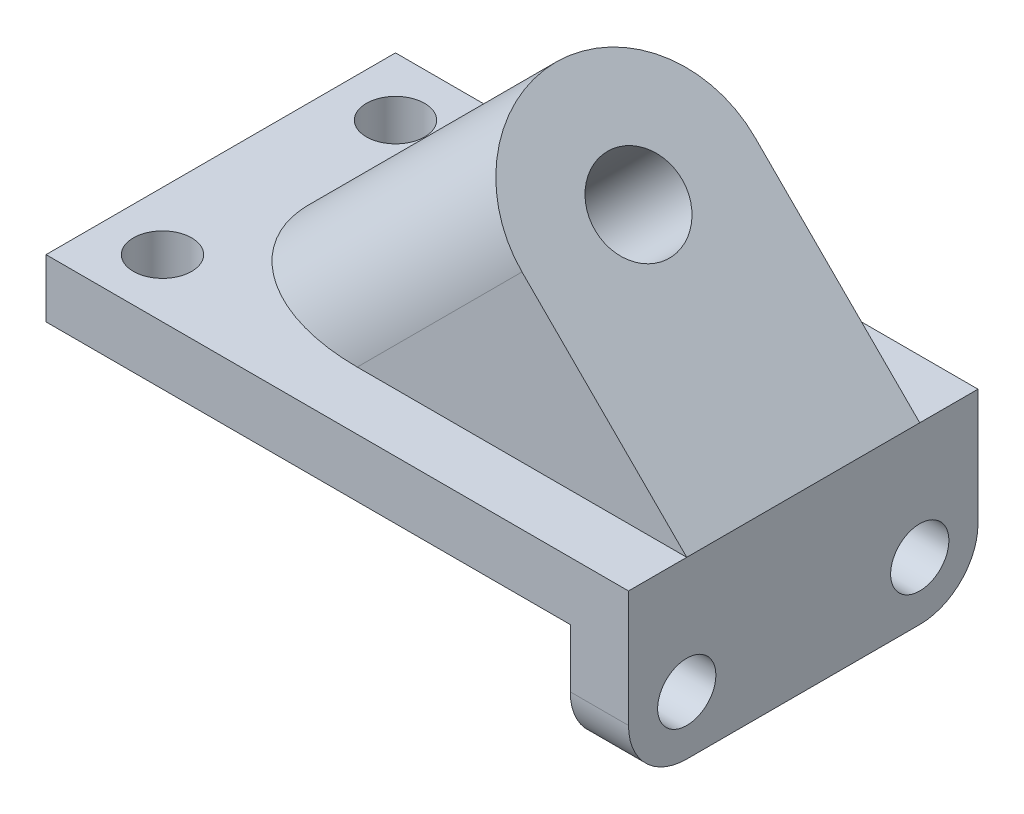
ISO-10303-21;
HEADER;
FILE_DESCRIPTION(('STEP AP214'),'2;1');
FILE_NAME('part.step','',(''),(''),'','','');
FILE_SCHEMA(('AUTOMOTIVE_DESIGN { 1 0 10303 214 1 1 1 1 }'));
ENDSEC;
DATA;
#1=APPLICATION_CONTEXT('core data for automotive mechanical design processes');
#2=APPLICATION_PROTOCOL_DEFINITION('international standard','automotive_design',2000,#1);
#3=PRODUCT_CONTEXT('',#1,'mechanical');
#4=PRODUCT('Part','Part','',(#3));
#5=PRODUCT_RELATED_PRODUCT_CATEGORY('part','',(#4));
#6=PRODUCT_DEFINITION_FORMATION('','',#4);
#7=PRODUCT_DEFINITION_CONTEXT('part definition',#1,'design');
#8=PRODUCT_DEFINITION('design','',#6,#7);
#9=PRODUCT_DEFINITION_SHAPE('','',#8);
#10=(LENGTH_UNIT() NAMED_UNIT(*) SI_UNIT(.MILLI.,.METRE.));
#11=(NAMED_UNIT(*) PLANE_ANGLE_UNIT() SI_UNIT($,.RADIAN.));
#12=(NAMED_UNIT(*) SI_UNIT($,.STERADIAN.) SOLID_ANGLE_UNIT());
#13=UNCERTAINTY_MEASURE_WITH_UNIT(LENGTH_MEASURE(1.E-05),#10,'distance_accuracy_value','');
#14=(GEOMETRIC_REPRESENTATION_CONTEXT(3) GLOBAL_UNCERTAINTY_ASSIGNED_CONTEXT((#13)) GLOBAL_UNIT_ASSIGNED_CONTEXT((#10,
#11,#12)) REPRESENTATION_CONTEXT('',''));
#15=CARTESIAN_POINT('',(0.,0.,0.));
#16=DIRECTION('',(0.,0.,1.));
#17=DIRECTION('',(1.,0.,0.));
#18=AXIS2_PLACEMENT_3D('',#15,#16,#17);
#19=CARTESIAN_POINT('',(0.,-12.7,0.));
#20=DIRECTION('',(0.,-1.,0.));
#21=DIRECTION('',(0.,0.,-1.));
#22=AXIS2_PLACEMENT_3D('',#19,#20,#21);
#23=PLANE('',#22);
#24=CARTESIAN_POINT('',(42.4579510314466,-12.7,-38.1));
#25=DIRECTION('',(0.,-1.,0.));
#26=DIRECTION('',(1.,0.,0.));
#27=AXIS2_PLACEMENT_3D('',#24,#25,#26);
#28=ELLIPSE('',#27,13.4703841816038,9.52500000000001);
#29=CARTESIAN_POINT('',(55.9283352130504,-12.7,-38.1));
#30=VERTEX_POINT('',#29);
#31=EDGE_CURVE('E161',#30,#30,#28,.T.);
#32=ORIENTED_EDGE('',*,*,#31,.F.);
#33=EDGE_LOOP('',(#32));
#34=FACE_BOUND('',#33,.T.);
#35=CARTESIAN_POINT('',(12.7,-12.7,-63.5));
#36=DIRECTION('',(0.,1.,0.));
#37=DIRECTION('',(0.,0.,1.));
#38=AXIS2_PLACEMENT_3D('',#35,#36,#37);
#39=CIRCLE('',#38,6.35);
#40=CARTESIAN_POINT('',(12.7,-12.7,-57.15));
#41=VERTEX_POINT('',#40);
#42=EDGE_CURVE('E238',#41,#41,#39,.T.);
#43=ORIENTED_EDGE('',*,*,#42,.T.);
#44=EDGE_LOOP('',(#43));
#45=FACE_BOUND('',#44,.T.);
#46=CARTESIAN_POINT('',(12.7,-12.7,-12.7));
#47=DIRECTION('',(0.,1.,0.));
#48=DIRECTION('',(0.,0.,1.));
#49=AXIS2_PLACEMENT_3D('',#46,#47,#48);
#50=CIRCLE('',#49,6.35);
#51=CARTESIAN_POINT('',(12.7,-12.7,-6.35));
#52=VERTEX_POINT('',#51);
#53=EDGE_CURVE('E246',#52,#52,#50,.T.);
#54=ORIENTED_EDGE('',*,*,#53,.T.);
#55=EDGE_LOOP('',(#54));
#56=FACE_BOUND('',#55,.T.);
#57=DIRECTION('',(-1.,0.,0.));
#58=VECTOR('',#57,1.);
#59=CARTESIAN_POINT('',(0.,-12.7,-76.2));
#60=LINE('',#59,#58);
#61=CARTESIAN_POINT('',(114.3,-12.7,-76.2));
#62=VERTEX_POINT('',#61);
#63=CARTESIAN_POINT('',(0.,-12.7,-76.2));
#64=VERTEX_POINT('',#63);
#65=EDGE_CURVE('E263',#62,#64,#60,.T.);
#66=ORIENTED_EDGE('',*,*,#65,.F.);
#67=DIRECTION('',(0.,0.,1.));
#68=VECTOR('',#67,1.);
#69=CARTESIAN_POINT('',(114.3,-12.7,0.));
#70=LINE('',#69,#68);
#71=CARTESIAN_POINT('',(114.3,-12.7,0.));
#72=VERTEX_POINT('',#71);
#73=EDGE_CURVE('E224',#62,#72,#70,.T.);
#74=ORIENTED_EDGE('',*,*,#73,.T.);
#75=DIRECTION('',(1.,0.,0.));
#76=VECTOR('',#75,1.);
#77=CARTESIAN_POINT('',(0.,-12.7,0.));
#78=LINE('',#77,#76);
#79=CARTESIAN_POINT('',(0.,-12.7,0.));
#80=VERTEX_POINT('',#79);
#81=EDGE_CURVE('E258',#80,#72,#78,.T.);
#82=ORIENTED_EDGE('',*,*,#81,.F.);
#83=DIRECTION('',(0.,0.,1.));
#84=VECTOR('',#83,1.);
#85=CARTESIAN_POINT('',(0.,-12.7,0.));
#86=LINE('',#85,#84);
#87=EDGE_CURVE('E254',#64,#80,#86,.T.);
#88=ORIENTED_EDGE('',*,*,#87,.F.);
#89=EDGE_LOOP('',(#66,#74,#82,#88));
#90=FACE_BOUND('',#89,.T.);
#91=ADVANCED_FACE('F45',(#34,#45,#56,#90),#23,.T.);
#92=CARTESIAN_POINT('',(0.,-12.7,0.));
#93=DIRECTION('',(-1.,0.,0.));
#94=DIRECTION('',(0.,0.,1.));
#95=AXIS2_PLACEMENT_3D('',#92,#93,#94);
#96=PLANE('',#95);
#97=DIRECTION('',(0.,0.,1.));
#98=VECTOR('',#97,1.);
#99=CARTESIAN_POINT('',(0.,0.,0.));
#100=LINE('',#99,#98);
#101=CARTESIAN_POINT('',(0.,0.,-76.2));
#102=VERTEX_POINT('',#101);
#103=CARTESIAN_POINT('',(0.,0.,0.));
#104=VERTEX_POINT('',#103);
#105=EDGE_CURVE('E250',#102,#104,#100,.T.);
#106=ORIENTED_EDGE('',*,*,#105,.F.);
#107=DIRECTION('',(0.,1.,0.));
#108=VECTOR('',#107,1.);
#109=CARTESIAN_POINT('',(0.,-12.7,-76.2));
#110=LINE('',#109,#108);
#111=EDGE_CURVE('E11',#64,#102,#110,.T.);
#112=ORIENTED_EDGE('',*,*,#111,.F.);
#113=ORIENTED_EDGE('',*,*,#87,.T.);
#114=DIRECTION('',(0.,1.,0.));
#115=VECTOR('',#114,1.);
#116=CARTESIAN_POINT('',(0.,-12.7,0.));
#117=LINE('',#116,#115);
#118=EDGE_CURVE('E49',#80,#104,#117,.T.);
#119=ORIENTED_EDGE('',*,*,#118,.T.);
#120=EDGE_LOOP('',(#106,#112,#113,#119));
#121=FACE_BOUND('',#120,.T.);
#122=ADVANCED_FACE('F47',(#121),#96,.T.);
#123=CARTESIAN_POINT('',(0.,-12.7,-76.2));
#124=DIRECTION('',(0.,0.,-1.));
#125=DIRECTION('',(-1.,0.,0.));
#126=AXIS2_PLACEMENT_3D('',#123,#124,#125);
#127=PLANE('',#126);
#128=DIRECTION('',(0.,1.,0.));
#129=VECTOR('',#128,1.);
#130=CARTESIAN_POINT('',(114.3,0.,-76.2));
#131=LINE('',#130,#129);
#132=CARTESIAN_POINT('',(114.3,-25.3999999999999,-76.2));
#133=VERTEX_POINT('',#132);
#134=EDGE_CURVE('E205',#133,#62,#131,.T.);
#135=ORIENTED_EDGE('',*,*,#134,.T.);
#136=ORIENTED_EDGE('',*,*,#65,.T.);
#137=ORIENTED_EDGE('',*,*,#111,.T.);
#138=DIRECTION('',(-1.,0.,0.));
#139=VECTOR('',#138,1.);
#140=CARTESIAN_POINT('',(0.,0.,-76.2));
#141=LINE('',#140,#139);
#142=CARTESIAN_POINT('',(127.,0.,-76.2));
#143=VERTEX_POINT('',#142);
#144=EDGE_CURVE('E259',#143,#102,#141,.T.);
#145=ORIENTED_EDGE('',*,*,#144,.F.);
#146=DIRECTION('',(0.,1.,0.));
#147=VECTOR('',#146,1.);
#148=CARTESIAN_POINT('',(127.,-12.7,-76.2));
#149=LINE('',#148,#147);
#150=CARTESIAN_POINT('',(127.,-25.3999999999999,-76.2));
#151=VERTEX_POINT('',#150);
#152=EDGE_CURVE('E55',#151,#143,#149,.T.);
#153=ORIENTED_EDGE('',*,*,#152,.F.);
#154=DIRECTION('',(1.,0.,0.));
#155=VECTOR('',#154,1.);
#156=CARTESIAN_POINT('',(114.3,-25.3999999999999,-76.2));
#157=LINE('',#156,#155);
#158=EDGE_CURVE('E220',#133,#151,#157,.T.);
#159=ORIENTED_EDGE('',*,*,#158,.F.);
#160=EDGE_LOOP('',(#135,#136,#137,#145,#153,#159));
#161=FACE_BOUND('',#160,.T.);
#162=ADVANCED_FACE('F297',(#161),#127,.T.);
#163=CARTESIAN_POINT('',(127.,-12.7,0.));
#164=DIRECTION('',(1.,0.,0.));
#165=DIRECTION('',(0.,0.,-1.));
#166=AXIS2_PLACEMENT_3D('',#163,#164,#165);
#167=PLANE('',#166);
#168=DIRECTION('',(0.,0.,-1.));
#169=VECTOR('',#168,1.);
#170=CARTESIAN_POINT('',(127.,0.,0.));
#171=LINE('',#170,#169);
#172=CARTESIAN_POINT('',(127.,0.,0.));
#173=VERTEX_POINT('',#172);
#174=CARTESIAN_POINT('',(127.,0.,-12.7));
#175=VERTEX_POINT('',#174);
#176=EDGE_CURVE('E273',#173,#175,#171,.T.);
#177=ORIENTED_EDGE('',*,*,#176,.F.);
#178=DIRECTION('',(0.,1.,0.));
#179=VECTOR('',#178,1.);
#180=CARTESIAN_POINT('',(127.,-12.7,0.));
#181=LINE('',#180,#179);
#182=CARTESIAN_POINT('',(127.,-25.3999999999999,0.));
#183=VERTEX_POINT('',#182);
#184=EDGE_CURVE('E280',#183,#173,#181,.T.);
#185=ORIENTED_EDGE('',*,*,#184,.F.);
#186=CARTESIAN_POINT('',(127.,-25.4,-12.7));
#187=DIRECTION('',(1.,0.,0.));
#188=DIRECTION('',(0.,0.,-1.));
#189=AXIS2_PLACEMENT_3D('',#186,#187,#188);
#190=CIRCLE('',#189,12.7);
#191=CARTESIAN_POINT('',(127.,-38.1,-12.7000000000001));
#192=VERTEX_POINT('',#191);
#193=EDGE_CURVE('E185',#183,#192,#190,.T.);
#194=ORIENTED_EDGE('',*,*,#193,.T.);
#195=DIRECTION('',(0.,0.,-1.));
#196=VECTOR('',#195,1.);
#197=CARTESIAN_POINT('',(127.,-38.1,-12.7000000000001));
#198=LINE('',#197,#196);
#199=CARTESIAN_POINT('',(127.,-38.1,-63.4999999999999));
#200=VERTEX_POINT('',#199);
#201=EDGE_CURVE('E213',#192,#200,#198,.T.);
#202=ORIENTED_EDGE('',*,*,#201,.T.);
#203=CARTESIAN_POINT('',(127.,-25.4,-63.5));
#204=DIRECTION('',(1.,0.,0.));
#205=DIRECTION('',(0.,0.,-1.));
#206=AXIS2_PLACEMENT_3D('',#203,#204,#205);
#207=CIRCLE('',#206,12.7);
#208=EDGE_CURVE('E193',#200,#151,#207,.T.);
#209=ORIENTED_EDGE('',*,*,#208,.T.);
#210=ORIENTED_EDGE('',*,*,#152,.T.);
#211=CARTESIAN_POINT('',(127.,0.,-63.4999999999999));
#212=VERTEX_POINT('',#211);
#213=EDGE_CURVE('E272',#212,#143,#171,.T.);
#214=ORIENTED_EDGE('',*,*,#213,.F.);
#215=DIRECTION('',(0.,0.,-1.));
#216=VECTOR('',#215,1.);
#217=CARTESIAN_POINT('',(127.,0.,-12.7));
#218=LINE('',#217,#216);
#219=EDGE_CURVE('E152',#175,#212,#218,.T.);
#220=ORIENTED_EDGE('',*,*,#219,.F.);
#221=EDGE_LOOP('',(#177,#185,#194,#202,#209,#210,#214,#220));
#222=FACE_BOUND('',#221,.T.);
#223=CARTESIAN_POINT('',(127.,-25.4,-63.5));
#224=DIRECTION('',(1.,0.,0.));
#225=DIRECTION('',(0.,0.,-1.));
#226=AXIS2_PLACEMENT_3D('',#223,#224,#225);
#227=CIRCLE('',#226,6.35);
#228=CARTESIAN_POINT('',(127.,-25.4,-69.85));
#229=VERTEX_POINT('',#228);
#230=EDGE_CURVE('E165',#229,#229,#227,.T.);
#231=ORIENTED_EDGE('',*,*,#230,.F.);
#232=EDGE_LOOP('',(#231));
#233=FACE_BOUND('',#232,.T.);
#234=CARTESIAN_POINT('',(127.,-25.4,-12.7));
#235=DIRECTION('',(1.,0.,0.));
#236=DIRECTION('',(0.,0.,-1.));
#237=AXIS2_PLACEMENT_3D('',#234,#235,#236);
#238=CIRCLE('',#237,6.35);
#239=CARTESIAN_POINT('',(127.,-25.4,-19.05));
#240=VERTEX_POINT('',#239);
#241=EDGE_CURVE('E177',#240,#240,#238,.T.);
#242=ORIENTED_EDGE('',*,*,#241,.F.);
#243=EDGE_LOOP('',(#242));
#244=FACE_BOUND('',#243,.T.);
#245=ADVANCED_FACE('F316',(#222,#233,#244),#167,.T.);
#246=CARTESIAN_POINT('',(0.,-12.7,0.));
#247=DIRECTION('',(0.,0.,1.));
#248=DIRECTION('',(1.,0.,0.));
#249=AXIS2_PLACEMENT_3D('',#246,#247,#248);
#250=PLANE('',#249);
#251=ORIENTED_EDGE('',*,*,#184,.T.);
#252=DIRECTION('',(1.,0.,0.));
#253=VECTOR('',#252,1.);
#254=CARTESIAN_POINT('',(0.,0.,0.));
#255=LINE('',#254,#253);
#256=EDGE_CURVE('E269',#104,#173,#255,.T.);
#257=ORIENTED_EDGE('',*,*,#256,.F.);
#258=ORIENTED_EDGE('',*,*,#118,.F.);
#259=ORIENTED_EDGE('',*,*,#81,.T.);
#260=DIRECTION('',(0.,-1.,0.));
#261=VECTOR('',#260,1.);
#262=CARTESIAN_POINT('',(114.3,0.,0.));
#263=LINE('',#262,#261);
#264=CARTESIAN_POINT('',(114.3,-25.3999999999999,0.));
#265=VERTEX_POINT('',#264);
#266=EDGE_CURVE('E189',#72,#265,#263,.T.);
#267=ORIENTED_EDGE('',*,*,#266,.T.);
#268=DIRECTION('',(1.,0.,0.));
#269=VECTOR('',#268,1.);
#270=CARTESIAN_POINT('',(114.3,-25.3999999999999,0.));
#271=LINE('',#270,#269);
#272=EDGE_CURVE('E209',#265,#183,#271,.T.);
#273=ORIENTED_EDGE('',*,*,#272,.T.);
#274=EDGE_LOOP('',(#251,#257,#258,#259,#267,#273));
#275=FACE_BOUND('',#274,.T.);
#276=ADVANCED_FACE('F292',(#275),#250,.T.);
#277=CARTESIAN_POINT('',(0.,0.,0.));
#278=DIRECTION('',(0.,-1.,0.));
#279=DIRECTION('',(0.,0.,-1.));
#280=AXIS2_PLACEMENT_3D('',#277,#278,#279);
#281=PLANE('',#280);
#282=ORIENTED_EDGE('',*,*,#176,.T.);
#283=DIRECTION('',(-1.,0.,0.));
#284=VECTOR('',#283,1.);
#285=CARTESIAN_POINT('',(21.8899565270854,0.,-12.7));
#286=LINE('',#285,#284);
#287=CARTESIAN_POINT('',(55.1579510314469,0.,-12.7));
#288=VERTEX_POINT('',#287);
#289=EDGE_CURVE('E63',#175,#288,#286,.T.);
#290=ORIENTED_EDGE('',*,*,#289,.T.);
#291=CARTESIAN_POINT('',(55.1579510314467,0.,-38.1));
#292=DIRECTION('',(0.,-1.,0.));
#293=DIRECTION('',(1.,0.,0.));
#294=AXIS2_PLACEMENT_3D('',#291,#292,#293);
#295=ELLIPSE('',#294,35.9210244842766,25.4);
#296=CARTESIAN_POINT('',(55.1579510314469,0.,-63.5));
#297=VERTEX_POINT('',#296);
#298=EDGE_CURVE('E158',#288,#297,#295,.T.);
#299=ORIENTED_EDGE('',*,*,#298,.T.);
#300=DIRECTION('',(-1.,0.,0.));
#301=VECTOR('',#300,1.);
#302=CARTESIAN_POINT('',(21.8899565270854,0.,-63.5));
#303=LINE('',#302,#301);
#304=EDGE_CURVE('E69',#212,#297,#303,.T.);
#305=ORIENTED_EDGE('',*,*,#304,.F.);
#306=ORIENTED_EDGE('',*,*,#213,.T.);
#307=ORIENTED_EDGE('',*,*,#144,.T.);
#308=ORIENTED_EDGE('',*,*,#105,.T.);
#309=ORIENTED_EDGE('',*,*,#256,.T.);
#310=EDGE_LOOP('',(#282,#290,#299,#305,#306,#307,#308,#309));
#311=FACE_BOUND('',#310,.T.);
#312=CARTESIAN_POINT('',(12.7,0.,-12.7));
#313=DIRECTION('',(0.,1.,0.));
#314=DIRECTION('',(0.,0.,1.));
#315=AXIS2_PLACEMENT_3D('',#312,#313,#314);
#316=CIRCLE('',#315,6.35);
#317=CARTESIAN_POINT('',(12.7,0.,-6.35));
#318=VERTEX_POINT('',#317);
#319=EDGE_CURVE('E242',#318,#318,#316,.T.);
#320=ORIENTED_EDGE('',*,*,#319,.F.);
#321=EDGE_LOOP('',(#320));
#322=FACE_BOUND('',#321,.T.);
#323=CARTESIAN_POINT('',(12.7,0.,-63.5));
#324=DIRECTION('',(0.,1.,0.));
#325=DIRECTION('',(0.,0.,1.));
#326=AXIS2_PLACEMENT_3D('',#323,#324,#325);
#327=CIRCLE('',#326,6.35);
#328=CARTESIAN_POINT('',(12.7,0.,-57.15));
#329=VERTEX_POINT('',#328);
#330=EDGE_CURVE('E237',#329,#329,#327,.T.);
#331=ORIENTED_EDGE('',*,*,#330,.F.);
#332=EDGE_LOOP('',(#331));
#333=FACE_BOUND('',#332,.T.);
#334=ADVANCED_FACE('F293',(#311,#322,#333),#281,.F.);
#335=CARTESIAN_POINT('',(12.7,-12.7,-12.7));
#336=DIRECTION('',(0.,1.,0.));
#337=DIRECTION('',(0.,0.,1.));
#338=AXIS2_PLACEMENT_3D('',#335,#336,#337);
#339=CYLINDRICAL_SURFACE('',#338,6.35);
#340=ORIENTED_EDGE('',*,*,#53,.F.);
#341=EDGE_LOOP('',(#340));
#342=FACE_BOUND('',#341,.T.);
#343=ORIENTED_EDGE('',*,*,#319,.T.);
#344=EDGE_LOOP('',(#343));
#345=FACE_BOUND('',#344,.T.);
#346=ADVANCED_FACE('F342',(#342,#345),#339,.F.);
#347=CARTESIAN_POINT('',(12.7,-12.7,-63.5));
#348=DIRECTION('',(0.,1.,0.));
#349=DIRECTION('',(0.,0.,1.));
#350=AXIS2_PLACEMENT_3D('',#347,#348,#349);
#351=CYLINDRICAL_SURFACE('',#350,6.35);
#352=ORIENTED_EDGE('',*,*,#42,.F.);
#353=EDGE_LOOP('',(#352));
#354=FACE_BOUND('',#353,.T.);
#355=ORIENTED_EDGE('',*,*,#330,.T.);
#356=EDGE_LOOP('',(#355));
#357=FACE_BOUND('',#356,.T.);
#358=ADVANCED_FACE('F364',(#354,#357),#351,.F.);
#359=CARTESIAN_POINT('',(114.3,-25.4,-63.5));
#360=DIRECTION('',(1.,0.,0.));
#361=DIRECTION('',(0.,0.,-1.));
#362=AXIS2_PLACEMENT_3D('',#359,#360,#361);
#363=CYLINDRICAL_SURFACE('',#362,12.7);
#364=ORIENTED_EDGE('',*,*,#208,.F.);
#365=DIRECTION('',(1.,0.,0.));
#366=VECTOR('',#365,1.);
#367=CARTESIAN_POINT('',(114.3,-38.1,-63.4999999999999));
#368=LINE('',#367,#366);
#369=CARTESIAN_POINT('',(114.3,-38.1,-63.4999999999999));
#370=VERTEX_POINT('',#369);
#371=EDGE_CURVE('E225',#370,#200,#368,.T.);
#372=ORIENTED_EDGE('',*,*,#371,.F.);
#373=CARTESIAN_POINT('',(114.3,-25.4,-63.5));
#374=DIRECTION('',(1.,0.,0.));
#375=DIRECTION('',(0.,0.,-1.));
#376=AXIS2_PLACEMENT_3D('',#373,#374,#375);
#377=CIRCLE('',#376,12.7);
#378=EDGE_CURVE('E201',#370,#133,#377,.T.);
#379=ORIENTED_EDGE('',*,*,#378,.T.);
#380=ORIENTED_EDGE('',*,*,#158,.T.);
#381=EDGE_LOOP('',(#364,#372,#379,#380));
#382=FACE_BOUND('',#381,.T.);
#383=ADVANCED_FACE('F361',(#382),#363,.T.);
#384=CARTESIAN_POINT('',(114.3,-38.1,-12.7000000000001));
#385=DIRECTION('',(0.,-1.,0.));
#386=DIRECTION('',(0.,0.,-1.));
#387=AXIS2_PLACEMENT_3D('',#384,#385,#386);
#388=PLANE('',#387);
#389=ORIENTED_EDGE('',*,*,#201,.F.);
#390=DIRECTION('',(1.,0.,0.));
#391=VECTOR('',#390,1.);
#392=CARTESIAN_POINT('',(114.3,-38.1,-12.7000000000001));
#393=LINE('',#392,#391);
#394=CARTESIAN_POINT('',(114.3,-38.1,-12.7000000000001));
#395=VERTEX_POINT('',#394);
#396=EDGE_CURVE('E228',#395,#192,#393,.T.);
#397=ORIENTED_EDGE('',*,*,#396,.F.);
#398=DIRECTION('',(0.,0.,-1.));
#399=VECTOR('',#398,1.);
#400=CARTESIAN_POINT('',(114.3,-38.1,-12.7000000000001));
#401=LINE('',#400,#399);
#402=EDGE_CURVE('E197',#395,#370,#401,.T.);
#403=ORIENTED_EDGE('',*,*,#402,.T.);
#404=ORIENTED_EDGE('',*,*,#371,.T.);
#405=EDGE_LOOP('',(#389,#397,#403,#404));
#406=FACE_BOUND('',#405,.T.);
#407=ADVANCED_FACE('F313',(#406),#388,.T.);
#408=CARTESIAN_POINT('',(114.3,-25.4,-12.7));
#409=DIRECTION('',(1.,0.,0.));
#410=DIRECTION('',(0.,0.,-1.));
#411=AXIS2_PLACEMENT_3D('',#408,#409,#410);
#412=CYLINDRICAL_SURFACE('',#411,12.7);
#413=ORIENTED_EDGE('',*,*,#193,.F.);
#414=ORIENTED_EDGE('',*,*,#272,.F.);
#415=CARTESIAN_POINT('',(114.3,-25.4,-12.7));
#416=DIRECTION('',(1.,0.,0.));
#417=DIRECTION('',(0.,0.,-1.));
#418=AXIS2_PLACEMENT_3D('',#415,#416,#417);
#419=CIRCLE('',#418,12.7);
#420=EDGE_CURVE('E192',#265,#395,#419,.T.);
#421=ORIENTED_EDGE('',*,*,#420,.T.);
#422=ORIENTED_EDGE('',*,*,#396,.T.);
#423=EDGE_LOOP('',(#413,#414,#421,#422));
#424=FACE_BOUND('',#423,.T.);
#425=ADVANCED_FACE('F305',(#424),#412,.T.);
#426=CARTESIAN_POINT('',(114.3,-25.4,-12.7));
#427=DIRECTION('',(1.,0.,0.));
#428=DIRECTION('',(0.,0.,-1.));
#429=AXIS2_PLACEMENT_3D('',#426,#427,#428);
#430=PLANE('',#429);
#431=ORIENTED_EDGE('',*,*,#73,.F.);
#432=ORIENTED_EDGE('',*,*,#134,.F.);
#433=ORIENTED_EDGE('',*,*,#378,.F.);
#434=ORIENTED_EDGE('',*,*,#402,.F.);
#435=ORIENTED_EDGE('',*,*,#420,.F.);
#436=ORIENTED_EDGE('',*,*,#266,.F.);
#437=EDGE_LOOP('',(#431,#432,#433,#434,#435,#436));
#438=FACE_BOUND('',#437,.T.);
#439=CARTESIAN_POINT('',(114.3,-25.4,-63.5));
#440=DIRECTION('',(1.,0.,0.));
#441=DIRECTION('',(0.,0.,-1.));
#442=AXIS2_PLACEMENT_3D('',#439,#440,#441);
#443=CIRCLE('',#442,6.35);
#444=CARTESIAN_POINT('',(114.3,-25.4,-69.85));
#445=VERTEX_POINT('',#444);
#446=EDGE_CURVE('E173',#445,#445,#443,.T.);
#447=ORIENTED_EDGE('',*,*,#446,.T.);
#448=EDGE_LOOP('',(#447));
#449=FACE_BOUND('',#448,.T.);
#450=CARTESIAN_POINT('',(114.3,-25.4,-12.7));
#451=DIRECTION('',(1.,0.,0.));
#452=DIRECTION('',(0.,0.,-1.));
#453=AXIS2_PLACEMENT_3D('',#450,#451,#452);
#454=CIRCLE('',#453,6.35);
#455=CARTESIAN_POINT('',(114.3,-25.4,-19.05));
#456=VERTEX_POINT('',#455);
#457=EDGE_CURVE('E181',#456,#456,#454,.T.);
#458=ORIENTED_EDGE('',*,*,#457,.T.);
#459=EDGE_LOOP('',(#458));
#460=FACE_BOUND('',#459,.T.);
#461=ADVANCED_FACE('F307',(#438,#449,#460),#430,.F.);
#462=CARTESIAN_POINT('',(114.3,-25.4,-12.7));
#463=DIRECTION('',(1.,0.,0.));
#464=DIRECTION('',(0.,0.,-1.));
#465=AXIS2_PLACEMENT_3D('',#462,#463,#464);
#466=CYLINDRICAL_SURFACE('',#465,6.35);
#467=ORIENTED_EDGE('',*,*,#457,.F.);
#468=EDGE_LOOP('',(#467));
#469=FACE_BOUND('',#468,.T.);
#470=ORIENTED_EDGE('',*,*,#241,.T.);
#471=EDGE_LOOP('',(#470));
#472=FACE_BOUND('',#471,.T.);
#473=ADVANCED_FACE('F387',(#469,#472),#466,.F.);
#474=CARTESIAN_POINT('',(114.3,-25.4,-63.5));
#475=DIRECTION('',(1.,0.,0.));
#476=DIRECTION('',(0.,0.,-1.));
#477=AXIS2_PLACEMENT_3D('',#474,#475,#476);
#478=CYLINDRICAL_SURFACE('',#477,6.35);
#479=ORIENTED_EDGE('',*,*,#446,.F.);
#480=EDGE_LOOP('',(#479));
#481=FACE_BOUND('',#480,.T.);
#482=ORIENTED_EDGE('',*,*,#230,.T.);
#483=EDGE_LOOP('',(#482));
#484=FACE_BOUND('',#483,.T.);
#485=ADVANCED_FACE('F395',(#481,#484),#478,.F.);
#486=CARTESIAN_POINT('',(91.0789755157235,35.9210244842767,-38.1));
#487=DIRECTION('',(-0.707106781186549,-0.707106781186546,0.));
#488=DIRECTION('',(0.707106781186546,-0.707106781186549,0.));
#489=AXIS2_PLACEMENT_3D('',#486,#487,#488);
#490=PLANE('',#489);
#491=CARTESIAN_POINT('',(91.0789755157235,35.9210244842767,-38.1));
#492=DIRECTION('',(0.707106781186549,0.707106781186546,0.));
#493=DIRECTION('',(-0.707106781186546,0.707106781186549,0.));
#494=AXIS2_PLACEMENT_3D('',#491,#492,#493);
#495=CIRCLE('',#494,9.52500000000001);
#496=CARTESIAN_POINT('',(84.3437834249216,42.6562165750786,-38.1));
#497=VERTEX_POINT('',#496);
#498=EDGE_CURVE('E505',#497,#497,#495,.T.);
#499=ORIENTED_EDGE('',*,*,#498,.F.);
#500=EDGE_LOOP('',(#499));
#501=FACE_BOUND('',#500,.T.);
#502=DIRECTION('',(-0.707106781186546,0.707106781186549,0.));
#503=VECTOR('',#502,1.);
#504=CARTESIAN_POINT('',(127.,0.,-12.7));
#505=LINE('',#504,#503);
#506=CARTESIAN_POINT('',(91.0789755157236,35.9210244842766,-12.7));
#507=VERTEX_POINT('',#506);
#508=EDGE_CURVE('E149',#175,#507,#505,.T.);
#509=ORIENTED_EDGE('',*,*,#508,.F.);
#510=ORIENTED_EDGE('',*,*,#219,.T.);
#511=DIRECTION('',(-0.707106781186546,0.707106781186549,0.));
#512=VECTOR('',#511,1.);
#513=CARTESIAN_POINT('',(127.,0.,-63.5));
#514=LINE('',#513,#512);
#515=CARTESIAN_POINT('',(91.0789755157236,35.9210244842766,-63.5));
#516=VERTEX_POINT('',#515);
#517=EDGE_CURVE('E135',#212,#516,#514,.T.);
#518=ORIENTED_EDGE('',*,*,#517,.T.);
#519=CARTESIAN_POINT('',(91.0789755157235,35.9210244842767,-38.1));
#520=DIRECTION('',(-0.707106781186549,-0.707106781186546,0.));
#521=DIRECTION('',(0.707106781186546,-0.707106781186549,0.));
#522=AXIS2_PLACEMENT_3D('',#519,#520,#521);
#523=CIRCLE('',#522,25.4);
#524=EDGE_CURVE('E143',#507,#516,#523,.T.);
#525=ORIENTED_EDGE('',*,*,#524,.F.);
#526=EDGE_LOOP('',(#509,#510,#518,#525));
#527=FACE_BOUND('',#526,.T.);
#528=ADVANCED_FACE('F151',(#501,#527),#490,.F.);
#529=CARTESIAN_POINT('',(21.8899565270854,-105.110043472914,-63.5));
#530=DIRECTION('',(0.,0.,-1.));
#531=DIRECTION('',(-1.,0.,0.));
#532=AXIS2_PLACEMENT_3D('',#529,#530,#531);
#533=PLANE('',#532);
#534=ORIENTED_EDGE('',*,*,#517,.F.);
#535=ORIENTED_EDGE('',*,*,#304,.T.);
#536=DIRECTION('',(0.707106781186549,0.707106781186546,0.));
#537=VECTOR('',#536,1.);
#538=CARTESIAN_POINT('',(-14.0310679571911,-69.1890189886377,-63.5));
#539=LINE('',#538,#537);
#540=EDGE_CURVE('E131',#297,#516,#539,.T.);
#541=ORIENTED_EDGE('',*,*,#540,.T.);
#542=EDGE_LOOP('',(#534,#535,#541));
#543=FACE_BOUND('',#542,.T.);
#544=ADVANCED_FACE('F133',(#543),#533,.T.);
#545=CARTESIAN_POINT('',(-14.0310679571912,-69.1890189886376,-38.1));
#546=DIRECTION('',(0.707106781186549,0.707106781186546,0.));
#547=DIRECTION('',(-0.707106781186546,0.707106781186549,0.));
#548=AXIS2_PLACEMENT_3D('',#545,#546,#547);
#549=CYLINDRICAL_SURFACE('',#548,25.4);
#550=ORIENTED_EDGE('',*,*,#298,.F.);
#551=DIRECTION('',(0.707106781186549,0.707106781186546,0.));
#552=VECTOR('',#551,1.);
#553=CARTESIAN_POINT('',(-14.0310679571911,-69.1890189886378,-12.7));
#554=LINE('',#553,#552);
#555=EDGE_CURVE('E140',#288,#507,#554,.T.);
#556=ORIENTED_EDGE('',*,*,#555,.T.);
#557=ORIENTED_EDGE('',*,*,#524,.T.);
#558=ORIENTED_EDGE('',*,*,#540,.F.);
#559=EDGE_LOOP('',(#550,#556,#557,#558));
#560=FACE_BOUND('',#559,.T.);
#561=ADVANCED_FACE('F144',(#560),#549,.T.);
#562=CARTESIAN_POINT('',(21.8899565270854,-105.110043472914,-12.7));
#563=DIRECTION('',(0.,0.,-1.));
#564=DIRECTION('',(0.,1.,0.));
#565=AXIS2_PLACEMENT_3D('',#562,#563,#564);
#566=PLANE('',#565);
#567=ORIENTED_EDGE('',*,*,#289,.F.);
#568=ORIENTED_EDGE('',*,*,#508,.T.);
#569=ORIENTED_EDGE('',*,*,#555,.F.);
#570=EDGE_LOOP('',(#567,#568,#569));
#571=FACE_BOUND('',#570,.T.);
#572=ADVANCED_FACE('F319',(#571),#566,.F.);
#573=CARTESIAN_POINT('',(19.2369265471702,-35.9210244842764,-38.1));
#574=DIRECTION('',(0.707106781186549,0.707106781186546,0.));
#575=DIRECTION('',(-0.707106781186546,0.707106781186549,0.));
#576=AXIS2_PLACEMENT_3D('',#573,#574,#575);
#577=CYLINDRICAL_SURFACE('',#576,9.52500000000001);
#578=ORIENTED_EDGE('',*,*,#31,.T.);
#579=EDGE_LOOP('',(#578));
#580=FACE_BOUND('',#579,.T.);
#581=ORIENTED_EDGE('',*,*,#498,.T.);
#582=EDGE_LOOP('',(#581));
#583=FACE_BOUND('',#582,.T.);
#584=ADVANCED_FACE('F321',(#580,#583),#577,.F.);
#585=CLOSED_SHELL('',(#91,#122,#162,#245,#276,#334,#346,#358,#383,#407,#425,#461,#473,#485,#528,
#544,#561,#572,#584));
#586=MANIFOLD_SOLID_BREP('B2',#585);
#587=ADVANCED_BREP_SHAPE_REPRESENTATION('',(#18,#586),#14);
#588=SHAPE_DEFINITION_REPRESENTATION(#9,#587);
ENDSEC;
END-ISO-10303-21;
